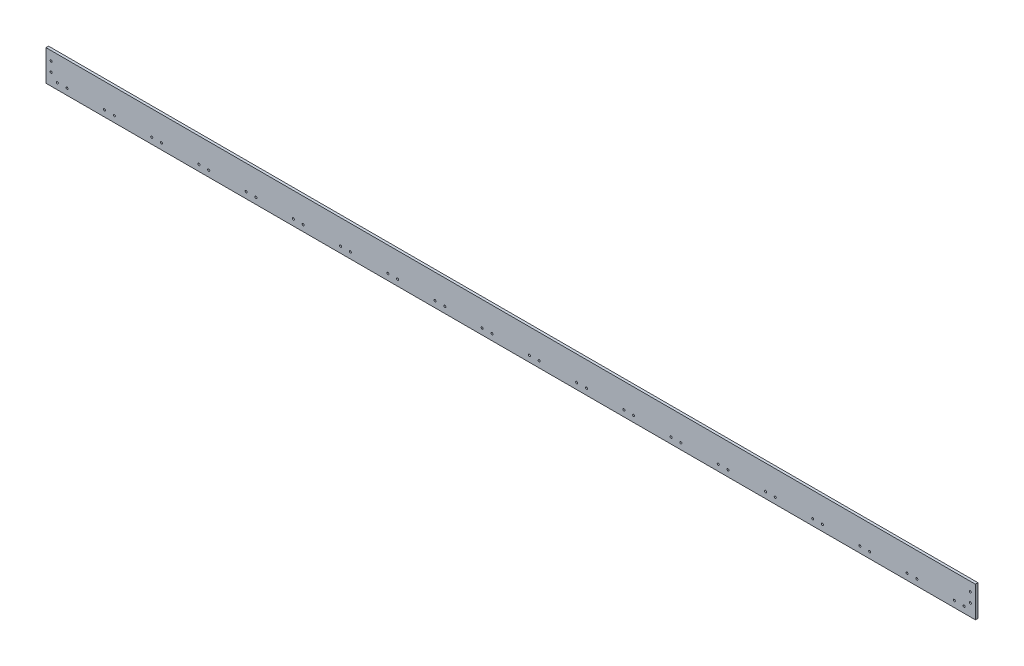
from build123d import *

# Parameters (mm, degrees)
SKETCH1_W           = 2292.35
SKETCH1_H           = 76.2
BOSS_EXTRUDE1_DEPTH = 6.35
SKETCH2_R           = 2.54
CUT_EXTRUDE1_DEPTH  = 6.35
SKETCH3_R           = 2.54
CUT_EXTRUDE2_DEPTH  = 6.35
LPATTERN2_COUNT     = 20
LPATTERN2_PITCH     = 116.438947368


with BuildPart() as part:
    # Sketch1 → Boss-Extrude1 (new body)
    with BuildSketch(Plane.XY):
        with Locations((1146.175, 38.1)):
            Rectangle(SKETCH1_W, SKETCH1_H)
    extrude(amount=BOSS_EXTRUDE1_DEPTH)

    # Sketch2 → Cut-Extrude1 (cut)
    with BuildSketch(Plane.XY.offset(6.35)):
        with Locations((27.94, 15.24)):
            Circle(SKETCH2_R)
        with Locations((52.07, 15.24)):
            Circle(SKETCH2_R)
    cut_extrude1 = extrude(amount=-CUT_EXTRUDE1_DEPTH, mode=Mode.SUBTRACT)

    # Sketch3 → Cut-Extrude2 (cut)
    with BuildSketch(Plane.XY.offset(6.35)):
        with Locations((12.7, 29.845)):
            Circle(SKETCH3_R)
        with Locations((12.7, 53.975)):
            Circle(SKETCH3_R)
        with Locations(Location((2279.65, 29.845, 0), (0, 0, 180))):
            Circle(SKETCH3_R)
        with Locations(Location((2279.65, 53.975, 0), (0, 0, 180))):
            Circle(SKETCH3_R)
    extrude(amount=-CUT_EXTRUDE2_DEPTH, mode=Mode.SUBTRACT)

    # LPattern2: Cut-Extrude1 ×20
    with Locations(*[(i * LPATTERN2_PITCH, 0, 0) for i in range(1, LPATTERN2_COUNT)]):
        add(cut_extrude1, mode=Mode.SUBTRACT)


solid = part.part
